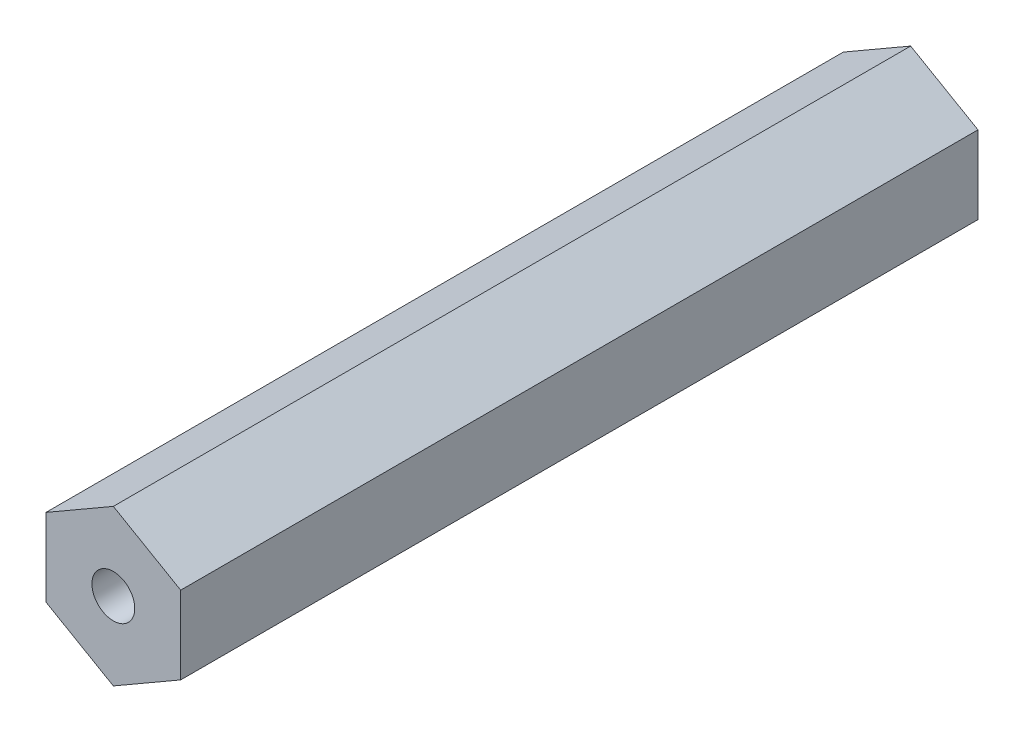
from build123d import *

# Parameters (mm, degrees)
BOSS_EXTRUDE1_DEPTH            = 75.184
TAP_DRILL_FOR_10_32_TAP1_D     = 4.0386
TAP_DRILL_FOR_10_32_TAP1_DEPTH = 12.7
TAP_DRILL_FOR_10_32_TAP1_TIP   = 1.213317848
TAP_DRILL_FOR_10_32_TAP2_D     = 4.0386
TAP_DRILL_FOR_10_32_TAP2_DEPTH = 12.7
TAP_DRILL_FOR_10_32_TAP2_TIP   = 1.213317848


with BuildPart() as part:
    # Sketch1 → Boss-Extrude1 (new body)
    with BuildSketch(Plane.XY):
        Polygon((0, 7.332348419), (-6.35, 3.666174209), (-6.35, -3.666174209), (0, -7.332348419), (6.35, -3.666174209), (6.35, 3.666174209), align=None)
    extrude(amount=BOSS_EXTRUDE1_DEPTH)

    # Tap Drill for _10-32 Tap1
    with Locations(Plane(origin=(0, 0, 0), x_dir=(-1, 0, 0), z_dir=(0, 0, -1))):
        with Locations((0, 0)):
            Hole(TAP_DRILL_FOR_10_32_TAP1_D / 2, depth=TAP_DRILL_FOR_10_32_TAP1_DEPTH)
            with Locations((0, 0, -(TAP_DRILL_FOR_10_32_TAP1_DEPTH + TAP_DRILL_FOR_10_32_TAP1_TIP / 2))):  # 118° drill point
                Cone(0, TAP_DRILL_FOR_10_32_TAP1_D / 2, TAP_DRILL_FOR_10_32_TAP1_TIP, mode=Mode.SUBTRACT)

    # Tap Drill for _10-32 Tap2
    with Locations(Plane.XY.offset(75.184)):
        with Locations((0, 0)):
            Hole(TAP_DRILL_FOR_10_32_TAP2_D / 2, depth=TAP_DRILL_FOR_10_32_TAP2_DEPTH)
            with Locations((0, 0, -(TAP_DRILL_FOR_10_32_TAP2_DEPTH + TAP_DRILL_FOR_10_32_TAP2_TIP / 2))):  # 118° drill point
                Cone(0, TAP_DRILL_FOR_10_32_TAP2_D / 2, TAP_DRILL_FOR_10_32_TAP2_TIP, mode=Mode.SUBTRACT)


solid = part.part
